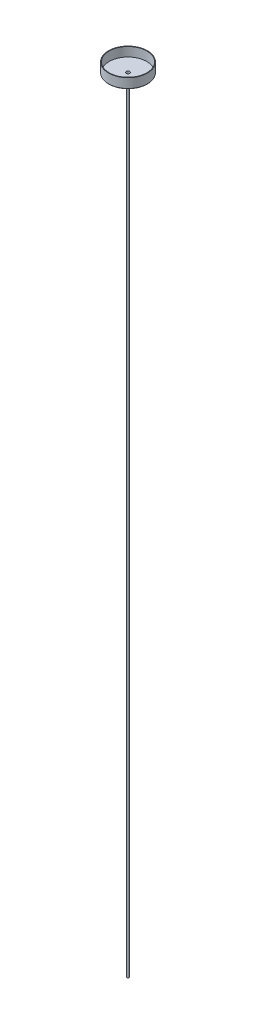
from build123d import *

# Parameters (mm, degrees)
CROQUIS1_R              = 3
SALIENTE_EXTRUIR1_DEPTH = 2000
CROQUIS2_R              = 6
SALIENTE_EXTRUIR2_DEPTH = 15
CROQUIS3_R              = 50
SALIENTE_EXTRUIR3_DEPTH = 25
REDONDEO1_R             = 1
VACIADO1_T              = -1.5


with BuildPart() as part:
    # Croquis1 → Saliente-Extruir1 (new body)
    with BuildSketch(Plane(origin=(0, 0, 0), x_dir=(1, 0, 0), z_dir=(0, 1, 0))):
        with Locations(Location((0, 0, 0), (0, 0, 270))):
            Circle(CROQUIS1_R)
    extrude(amount=SALIENTE_EXTRUIR1_DEPTH)


with BuildPart() as body_2:
    # Croquis2 → Saliente-Extruir2 (new body)
    with BuildSketch(Plane(origin=(0, 2000, 0), x_dir=(1, 0, 0), z_dir=(0, 1, 0))):
        with Locations(Location((0, 0, 0), (0, 0, 270))):
            Circle(CROQUIS2_R)
    extrude(amount=SALIENTE_EXTRUIR2_DEPTH)

    # Croquis3 → Saliente-Extruir3 (add)
    with BuildSketch(Plane(origin=(0, 2015, 0), x_dir=(1, 0, 0), z_dir=(0, 1, 0))):
        with Locations(Location((0, 0, 0), (0, 0, 270))):
            Circle(CROQUIS3_R)
    extrude(amount=SALIENTE_EXTRUIR3_DEPTH)

    # Redondeo1
    redondeo1_edges = [body_2.edges().sort_by_distance(p)[0] for p in [
        (0, 2015, -50),
    ]]
    fillet(redondeo1_edges, radius=REDONDEO1_R)

    # Vaciado1
    vaciado1_openings = [body_2.faces().sort_by_distance(p)[0] for p in [
        (0, 2040, 0),
    ]]
    offset(amount=VACIADO1_T, openings=vaciado1_openings, kind=Kind.INTERSECTION)


solid = Compound([part.part, body_2.part])
